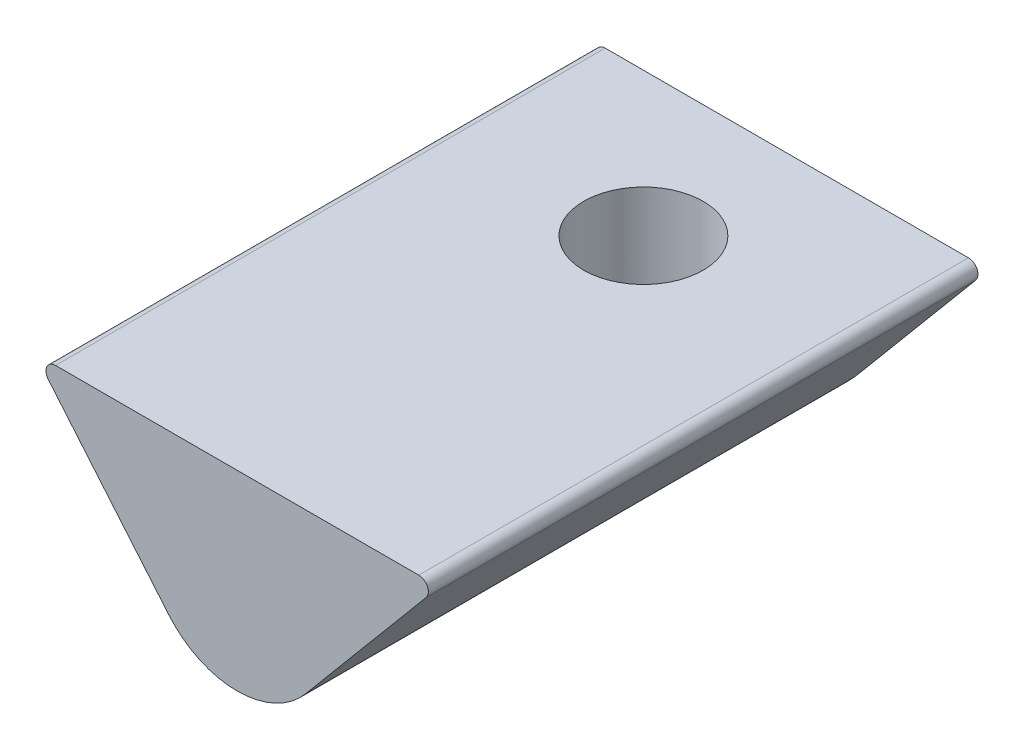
from build123d import *

# Parameters (mm, degrees)
AUFSATZ_LINEAR_AUSTRAGEN1_DEPTH = 11.5
M3_GEWINDEBOHRUNG1_D            = 2.5


with BuildPart() as part:
    # Skizze1 → Aufsatz-Linear austragen1 (new body)
    with BuildSketch(Plane.XY):
        with BuildLine():
            Line((-3.8, 0), (3.8, 0))
            ThreePointArc((3.8, 0), (3.981261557, -0.115476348), (3.953208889, -0.328557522))
            Line((3.953208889, -0.328557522), (1.433336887, -3.331624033))
            ThreePointArc((1.433336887, -3.331624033), (0.790756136, -3.824693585), (0, -4))
            ThreePointArc((0, -4), (-0.790756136, -3.824693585), (-1.433336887, -3.331624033))
            Line((-1.433336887, -3.331624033), (-3.953208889, -0.328557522))
            ThreePointArc((-3.953208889, -0.328557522), (-3.981261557, -0.115476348), (-3.8, 0))
        make_face()
    extrude(amount=AUFSATZ_LINEAR_AUSTRAGEN1_DEPTH)

    # M3 Gewindebohrung1 (through all)
    with Locations(Plane(origin=(0, 0, 0), x_dir=(1, 0, 0), z_dir=(0, 1, 0))):
        with Locations((0, -3)):
            Hole(M3_GEWINDEBOHRUNG1_D / 2)


solid = part.part
